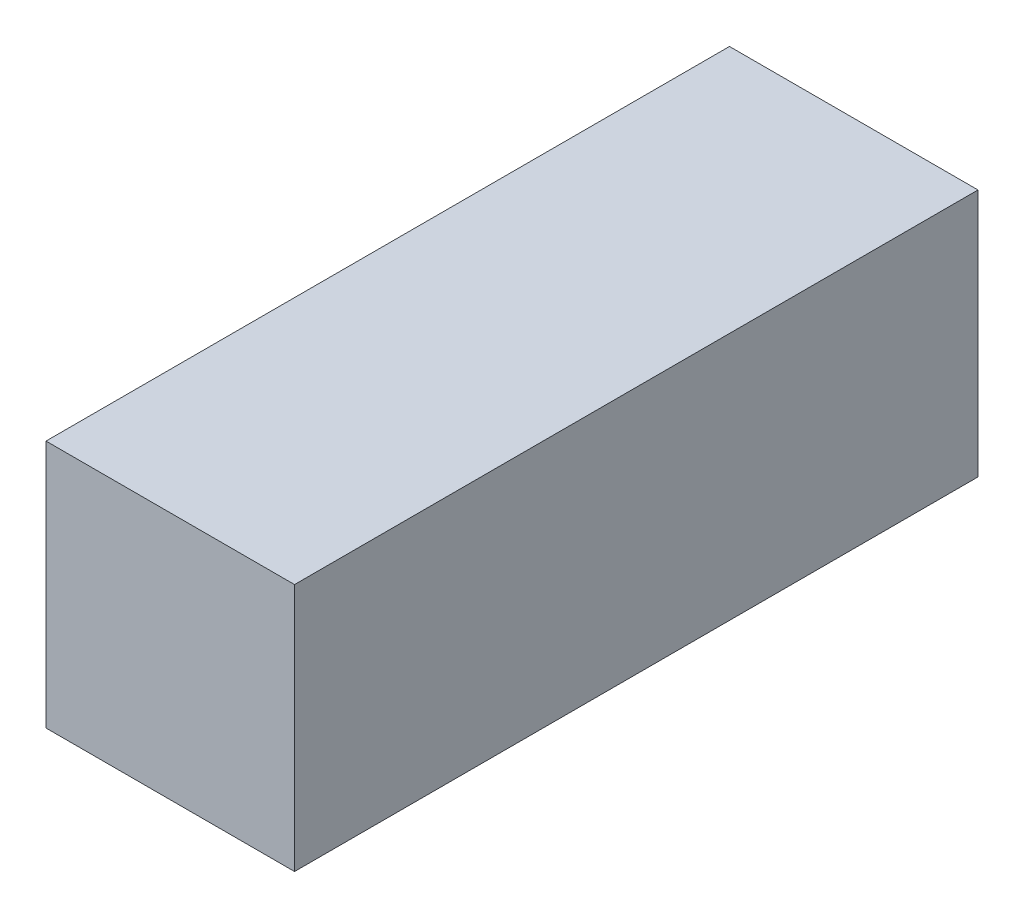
ISO-10303-21;
HEADER;
FILE_DESCRIPTION(('STEP AP214'),'2;1');
FILE_NAME('part.step','',(''),(''),'','','');
FILE_SCHEMA(('AUTOMOTIVE_DESIGN { 1 0 10303 214 1 1 1 1 }'));
ENDSEC;
DATA;
#1=APPLICATION_CONTEXT('core data for automotive mechanical design processes');
#2=APPLICATION_PROTOCOL_DEFINITION('international standard','automotive_design',2000,#1);
#3=PRODUCT_CONTEXT('',#1,'mechanical');
#4=PRODUCT('Part','Part','',(#3));
#5=PRODUCT_RELATED_PRODUCT_CATEGORY('part','',(#4));
#6=PRODUCT_DEFINITION_FORMATION('','',#4);
#7=PRODUCT_DEFINITION_CONTEXT('part definition',#1,'design');
#8=PRODUCT_DEFINITION('design','',#6,#7);
#9=PRODUCT_DEFINITION_SHAPE('','',#8);
#10=(LENGTH_UNIT() NAMED_UNIT(*) SI_UNIT(.MILLI.,.METRE.));
#11=(NAMED_UNIT(*) PLANE_ANGLE_UNIT() SI_UNIT($,.RADIAN.));
#12=(NAMED_UNIT(*) SI_UNIT($,.STERADIAN.) SOLID_ANGLE_UNIT());
#13=UNCERTAINTY_MEASURE_WITH_UNIT(LENGTH_MEASURE(1.E-05),#10,'distance_accuracy_value','');
#14=(GEOMETRIC_REPRESENTATION_CONTEXT(3) GLOBAL_UNCERTAINTY_ASSIGNED_CONTEXT((#13)) GLOBAL_UNIT_ASSIGNED_CONTEXT((#10,
#11,#12)) REPRESENTATION_CONTEXT('',''));
#15=CARTESIAN_POINT('',(0.,0.,0.));
#16=DIRECTION('',(0.,0.,1.));
#17=DIRECTION('',(1.,0.,0.));
#18=AXIS2_PLACEMENT_3D('',#15,#16,#17);
#19=CARTESIAN_POINT('',(24.,-278.,-20.));
#20=DIRECTION('',(-1.,0.,0.));
#21=DIRECTION('',(0.,0.,1.));
#22=AXIS2_PLACEMENT_3D('',#19,#20,#21);
#23=PLANE('',#22);
#24=DIRECTION('',(0.,0.,1.));
#25=VECTOR('',#24,1.);
#26=CARTESIAN_POINT('',(24.,-278.,-20.));
#27=LINE('',#26,#25);
#28=CARTESIAN_POINT('',(24.,-278.,-20.));
#29=VERTEX_POINT('',#28);
#30=CARTESIAN_POINT('',(24.,-278.,200.));
#31=VERTEX_POINT('',#30);
#32=EDGE_CURVE('E37',#29,#31,#27,.T.);
#33=ORIENTED_EDGE('',*,*,#32,.T.);
#34=DIRECTION('',(0.,-1.,0.));
#35=VECTOR('',#34,1.);
#36=CARTESIAN_POINT('',(24.,-278.,200.));
#37=LINE('',#36,#35);
#38=CARTESIAN_POINT('',(24.,-198.,200.));
#39=VERTEX_POINT('',#38);
#40=EDGE_CURVE('E74',#39,#31,#37,.T.);
#41=ORIENTED_EDGE('',*,*,#40,.F.);
#42=DIRECTION('',(0.,0.,1.));
#43=VECTOR('',#42,1.);
#44=CARTESIAN_POINT('',(24.,-198.,-20.));
#45=LINE('',#44,#43);
#46=CARTESIAN_POINT('',(24.,-198.,-20.));
#47=VERTEX_POINT('',#46);
#48=EDGE_CURVE('E11',#47,#39,#45,.T.);
#49=ORIENTED_EDGE('',*,*,#48,.F.);
#50=DIRECTION('',(0.,-1.,0.));
#51=VECTOR('',#50,1.);
#52=CARTESIAN_POINT('',(24.,-278.,-20.));
#53=LINE('',#52,#51);
#54=EDGE_CURVE('E75',#47,#29,#53,.T.);
#55=ORIENTED_EDGE('',*,*,#54,.T.);
#56=EDGE_LOOP('',(#33,#41,#49,#55));
#57=FACE_BOUND('',#56,.T.);
#58=ADVANCED_FACE('F34',(#57),#23,.T.);
#59=CARTESIAN_POINT('',(24.,-198.,-20.));
#60=DIRECTION('',(0.,1.,0.));
#61=DIRECTION('',(0.,0.,1.));
#62=AXIS2_PLACEMENT_3D('',#59,#60,#61);
#63=PLANE('',#62);
#64=ORIENTED_EDGE('',*,*,#48,.T.);
#65=DIRECTION('',(-1.,0.,0.));
#66=VECTOR('',#65,1.);
#67=CARTESIAN_POINT('',(24.,-198.,200.));
#68=LINE('',#67,#66);
#69=CARTESIAN_POINT('',(104.,-198.,200.));
#70=VERTEX_POINT('',#69);
#71=EDGE_CURVE('E91',#70,#39,#68,.T.);
#72=ORIENTED_EDGE('',*,*,#71,.F.);
#73=DIRECTION('',(0.,0.,1.));
#74=VECTOR('',#73,1.);
#75=CARTESIAN_POINT('',(104.,-198.,-20.));
#76=LINE('',#75,#74);
#77=CARTESIAN_POINT('',(104.,-198.,-20.));
#78=VERTEX_POINT('',#77);
#79=EDGE_CURVE('E42',#78,#70,#76,.T.);
#80=ORIENTED_EDGE('',*,*,#79,.F.);
#81=DIRECTION('',(-1.,0.,0.));
#82=VECTOR('',#81,1.);
#83=CARTESIAN_POINT('',(24.,-198.,-20.));
#84=LINE('',#83,#82);
#85=EDGE_CURVE('E80',#78,#47,#84,.T.);
#86=ORIENTED_EDGE('',*,*,#85,.T.);
#87=EDGE_LOOP('',(#64,#72,#80,#86));
#88=FACE_BOUND('',#87,.T.);
#89=ADVANCED_FACE('F106',(#88),#63,.T.);
#90=CARTESIAN_POINT('',(104.,-278.,-20.));
#91=DIRECTION('',(1.,0.,0.));
#92=DIRECTION('',(0.,0.,-1.));
#93=AXIS2_PLACEMENT_3D('',#90,#91,#92);
#94=PLANE('',#93);
#95=ORIENTED_EDGE('',*,*,#79,.T.);
#96=DIRECTION('',(0.,1.,0.));
#97=VECTOR('',#96,1.);
#98=CARTESIAN_POINT('',(104.,-278.,200.));
#99=LINE('',#98,#97);
#100=CARTESIAN_POINT('',(104.,-278.,200.));
#101=VERTEX_POINT('',#100);
#102=EDGE_CURVE('E87',#101,#70,#99,.T.);
#103=ORIENTED_EDGE('',*,*,#102,.F.);
#104=DIRECTION('',(0.,0.,1.));
#105=VECTOR('',#104,1.);
#106=CARTESIAN_POINT('',(104.,-278.,-20.));
#107=LINE('',#106,#105);
#108=CARTESIAN_POINT('',(104.,-278.,-20.));
#109=VERTEX_POINT('',#108);
#110=EDGE_CURVE('E79',#109,#101,#107,.T.);
#111=ORIENTED_EDGE('',*,*,#110,.F.);
#112=DIRECTION('',(0.,1.,0.));
#113=VECTOR('',#112,1.);
#114=CARTESIAN_POINT('',(104.,-278.,-20.));
#115=LINE('',#114,#113);
#116=EDGE_CURVE('E99',#109,#78,#115,.T.);
#117=ORIENTED_EDGE('',*,*,#116,.T.);
#118=EDGE_LOOP('',(#95,#103,#111,#117));
#119=FACE_BOUND('',#118,.T.);
#120=ADVANCED_FACE('F103',(#119),#94,.T.);
#121=CARTESIAN_POINT('',(24.,-278.,-20.));
#122=DIRECTION('',(0.,-1.,0.));
#123=DIRECTION('',(0.,0.,-1.));
#124=AXIS2_PLACEMENT_3D('',#121,#122,#123);
#125=PLANE('',#124);
#126=ORIENTED_EDGE('',*,*,#110,.T.);
#127=DIRECTION('',(1.,0.,0.));
#128=VECTOR('',#127,1.);
#129=CARTESIAN_POINT('',(24.,-278.,200.));
#130=LINE('',#129,#128);
#131=EDGE_CURVE('E82',#31,#101,#130,.T.);
#132=ORIENTED_EDGE('',*,*,#131,.F.);
#133=ORIENTED_EDGE('',*,*,#32,.F.);
#134=DIRECTION('',(1.,0.,0.));
#135=VECTOR('',#134,1.);
#136=CARTESIAN_POINT('',(24.,-278.,-20.));
#137=LINE('',#136,#135);
#138=EDGE_CURVE('E97',#29,#109,#137,.T.);
#139=ORIENTED_EDGE('',*,*,#138,.T.);
#140=EDGE_LOOP('',(#126,#132,#133,#139));
#141=FACE_BOUND('',#140,.T.);
#142=ADVANCED_FACE('F83',(#141),#125,.T.);
#143=CARTESIAN_POINT('',(24.,-198.,-20.));
#144=DIRECTION('',(0.,0.,-1.));
#145=DIRECTION('',(-1.,0.,0.));
#146=AXIS2_PLACEMENT_3D('',#143,#144,#145);
#147=PLANE('',#146);
#148=ORIENTED_EDGE('',*,*,#54,.F.);
#149=ORIENTED_EDGE('',*,*,#85,.F.);
#150=ORIENTED_EDGE('',*,*,#116,.F.);
#151=ORIENTED_EDGE('',*,*,#138,.F.);
#152=EDGE_LOOP('',(#148,#149,#150,#151));
#153=FACE_BOUND('',#152,.T.);
#154=ADVANCED_FACE('F108',(#153),#147,.T.);
#155=CARTESIAN_POINT('',(24.,-198.,200.));
#156=DIRECTION('',(0.,0.,-1.));
#157=DIRECTION('',(-1.,0.,0.));
#158=AXIS2_PLACEMENT_3D('',#155,#156,#157);
#159=PLANE('',#158);
#160=ORIENTED_EDGE('',*,*,#40,.T.);
#161=ORIENTED_EDGE('',*,*,#131,.T.);
#162=ORIENTED_EDGE('',*,*,#102,.T.);
#163=ORIENTED_EDGE('',*,*,#71,.T.);
#164=EDGE_LOOP('',(#160,#161,#162,#163));
#165=FACE_BOUND('',#164,.T.);
#166=ADVANCED_FACE('F90',(#165),#159,.F.);
#167=CLOSED_SHELL('',(#58,#89,#120,#142,#154,#166));
#168=MANIFOLD_SOLID_BREP('B2',#167);
#169=ADVANCED_BREP_SHAPE_REPRESENTATION('',(#18,#168),#14);
#170=SHAPE_DEFINITION_REPRESENTATION(#9,#169);
ENDSEC;
END-ISO-10303-21;
